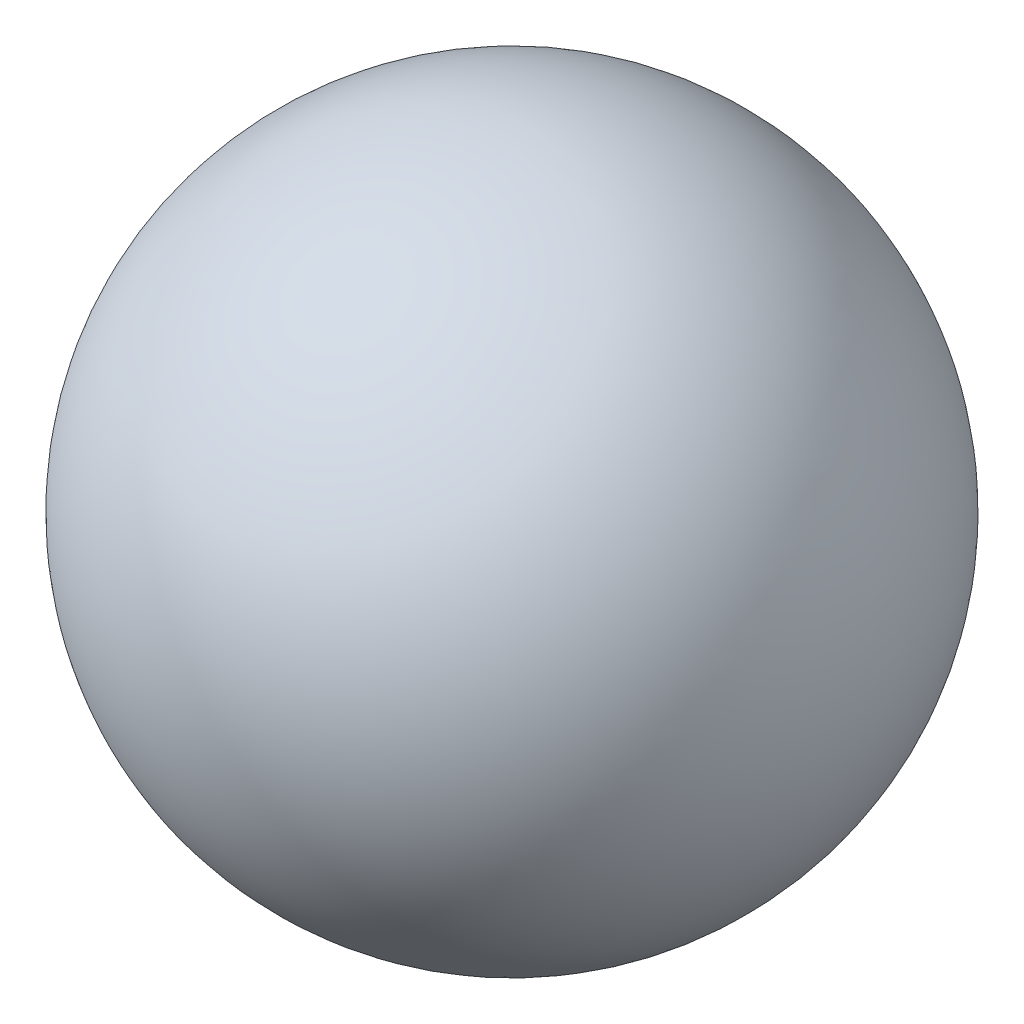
from build123d import *
from build123d.topology import SkipClean


with BuildPart() as part:
    # Sketch 1 → Revolve 3 (revolve)
    with SkipClean():  # the faces are left unmerged after this step: merging them gives an invalid solid
        with BuildSketch(Plane(origin=(0, 0, 0), x_dir=(1, 0, 0), z_dir=(0, 1, 0))):
            with BuildLine():
                ThreePointArc((50, 0), (35.355339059, 35.355339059), (0, 50))
                Line((0, 50), (0, -50))
                ThreePointArc((0, -50), (35.355339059, -35.355339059), (50, 0))
            make_face()
            with BuildLine():
                Line((0, -50), (0, 50))
                ThreePointArc((0, 50), (-50, 0), (0, -50))
            make_face()
        revolve(axis=Axis((0, 0, -50), (0, 0, 1)))


solid = part.part
